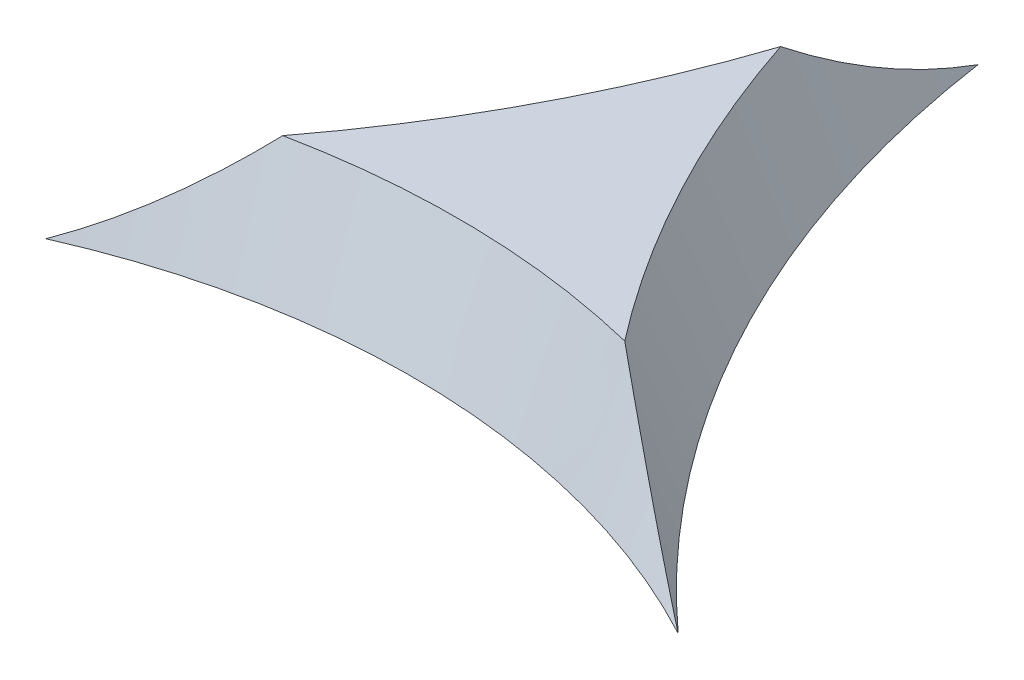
ISO-10303-21;
HEADER;
FILE_DESCRIPTION(('STEP AP214'),'2;1');
FILE_NAME('part.step','',(''),(''),'','','');
FILE_SCHEMA(('AUTOMOTIVE_DESIGN { 1 0 10303 214 1 1 1 1 }'));
ENDSEC;
DATA;
#1=APPLICATION_CONTEXT('core data for automotive mechanical design processes');
#2=APPLICATION_PROTOCOL_DEFINITION('international standard','automotive_design',2000,#1);
#3=PRODUCT_CONTEXT('',#1,'mechanical');
#4=PRODUCT('Part','Part','',(#3));
#5=PRODUCT_RELATED_PRODUCT_CATEGORY('part','',(#4));
#6=PRODUCT_DEFINITION_FORMATION('','',#4);
#7=PRODUCT_DEFINITION_CONTEXT('part definition',#1,'design');
#8=PRODUCT_DEFINITION('design','',#6,#7);
#9=PRODUCT_DEFINITION_SHAPE('','',#8);
#10=(LENGTH_UNIT() NAMED_UNIT(*) SI_UNIT(.MILLI.,.METRE.));
#11=(NAMED_UNIT(*) PLANE_ANGLE_UNIT() SI_UNIT($,.RADIAN.));
#12=(NAMED_UNIT(*) SI_UNIT($,.STERADIAN.) SOLID_ANGLE_UNIT());
#13=UNCERTAINTY_MEASURE_WITH_UNIT(LENGTH_MEASURE(1.E-05),#10,'distance_accuracy_value','');
#14=(GEOMETRIC_REPRESENTATION_CONTEXT(3) GLOBAL_UNCERTAINTY_ASSIGNED_CONTEXT((#13)) GLOBAL_UNIT_ASSIGNED_CONTEXT((#10,
#11,#12)) REPRESENTATION_CONTEXT('',''));
#15=CARTESIAN_POINT('',(0.,0.,0.));
#16=DIRECTION('',(0.,0.,1.));
#17=DIRECTION('',(1.,0.,0.));
#18=AXIS2_PLACEMENT_3D('',#15,#16,#17);
#19=CARTESIAN_POINT('',(-41.768203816,12.9,6.72190787));
#20=DIRECTION('',(0.,-1.,0.));
#21=DIRECTION('',(0.,0.,-1.));
#22=AXIS2_PLACEMENT_3D('',#19,#20,#21);
#23=PLANE('',#22);
#24=CARTESIAN_POINT('',(-40.5,12.9,12.8));
#25=DIRECTION('',(0.,1.,0.));
#26=DIRECTION('',(0.,0.,1.));
#27=AXIS2_PLACEMENT_3D('',#24,#25,#26);
#28=CIRCLE('',#27,6.27408270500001);
#29=CARTESIAN_POINT('',(-39.0068278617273,12.9000000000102,6.70618750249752));
#30=VERTEX_POINT('',#29);
#31=CARTESIAN_POINT('',(-41.7517343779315,12.9,6.65205116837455));
#32=VERTEX_POINT('',#31);
#33=EDGE_CURVE('E11',#30,#32,#28,.T.);
#34=ORIENTED_EDGE('',*,*,#33,.F.);
#35=CARTESIAN_POINT('',(-32.,12.9,1.3));
#36=DIRECTION('',(0.,1.,0.));
#37=DIRECTION('',(0.,0.,1.));
#38=AXIS2_PLACEMENT_3D('',#35,#36,#37);
#39=CIRCLE('',#38,8.85);
#40=CARTESIAN_POINT('',(-40.4000000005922,12.9,4.08612634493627));
#41=VERTEX_POINT('',#40);
#42=EDGE_CURVE('E71',#41,#30,#39,.T.);
#43=ORIENTED_EDGE('',*,*,#42,.F.);
#44=CARTESIAN_POINT('',(-48.8,12.9,1.3));
#45=DIRECTION('',(0.,1.,0.));
#46=DIRECTION('',(0.,0.,1.));
#47=AXIS2_PLACEMENT_3D('',#44,#45,#46);
#48=CIRCLE('',#47,8.85);
#49=EDGE_CURVE('E28',#32,#41,#48,.T.);
#50=ORIENTED_EDGE('',*,*,#49,.F.);
#51=EDGE_LOOP('',(#34,#43,#50));
#52=FACE_BOUND('',#51,.T.);
#53=ADVANCED_FACE('F16',(#52),#23,.F.);
#54=CARTESIAN_POINT('',(-40.5,12.,12.8));
#55=DIRECTION('',(0.,1.,0.));
#56=DIRECTION('',(0.,0.,1.));
#57=AXIS2_PLACEMENT_3D('',#54,#55,#56);
#58=CONICAL_SURFACE('',#57,5.914082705,0.380506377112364);
#59=CARTESIAN_POINT('',(-42.8807778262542,11.9999999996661,7.38628859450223));
#60=CARTESIAN_POINT('',(-42.8340665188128,12.0250127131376,7.35481564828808));
#61=CARTESIAN_POINT('',(-42.7878032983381,12.0513898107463,7.32378321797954));
#62=CARTESIAN_POINT('',(-42.6951118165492,12.1072774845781,7.26187571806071));
#63=CARTESIAN_POINT('',(-42.6487051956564,12.136847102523,7.23102145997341));
#64=CARTESIAN_POINT('',(-42.5556852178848,12.1991152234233,7.169446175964));
#65=CARTESIAN_POINT('',(-42.5090970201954,12.2318744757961,7.13874881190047));
#66=CARTESIAN_POINT('',(-42.4156686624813,12.3005212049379,7.07745759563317));
#67=CARTESIAN_POINT('',(-42.3688565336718,12.3364697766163,7.04688959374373));
#68=CARTESIAN_POINT('',(-42.274939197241,12.4114950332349,6.98582834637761));
#69=CARTESIAN_POINT('',(-42.2278643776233,12.450631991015,6.95536260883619));
#70=CARTESIAN_POINT('',(-42.1333825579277,12.5320357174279,6.89447648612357));
#71=CARTESIAN_POINT('',(-42.0860077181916,12.5743610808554,6.86408469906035));
#72=CARTESIAN_POINT('',(-41.9908894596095,12.6621417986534,6.80331690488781));
#73=CARTESIAN_POINT('',(-41.943179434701,12.7076533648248,6.77297006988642));
#74=CARTESIAN_POINT('',(-41.8473564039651,12.8018160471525,6.71226276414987));
#75=CARTESIAN_POINT('',(-41.7992775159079,12.8505208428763,6.68193158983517));
#76=CARTESIAN_POINT('',(-41.7517343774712,12.8999999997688,6.65205116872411));
#77=B_SPLINE_CURVE_WITH_KNOTS('',3,(#59,#60,#61,#62,#63,#64,#65,#66,#67,#68,#69,#70,#71,#72,#73,
#74,#75,#76),.UNSPECIFIED.,.F.,.F.,(4,2,2,2,2,2,2,2,4),(0.,0.184852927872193,0.37404714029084,
0.568088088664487,0.767442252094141,0.972537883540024,1.18376646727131,1.40148467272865,
1.62601661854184),.UNSPECIFIED.);
#78=CARTESIAN_POINT('',(-42.8807778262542,11.9999999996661,7.38628859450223));
#79=VERTEX_POINT('',#78);
#80=EDGE_CURVE('E78',#79,#32,#77,.T.);
#81=ORIENTED_EDGE('',*,*,#80,.F.);
#82=CARTESIAN_POINT('',(-40.5,12.,12.8));
#83=DIRECTION('',(0.,1.,0.));
#84=DIRECTION('',(0.,0.,1.));
#85=AXIS2_PLACEMENT_3D('',#82,#83,#84);
#86=CIRCLE('',#85,5.914082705);
#87=CARTESIAN_POINT('',(-37.7035871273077,12.0000000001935,7.58881498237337));
#88=VERTEX_POINT('',#87);
#89=EDGE_CURVE('E74',#88,#79,#86,.T.);
#90=ORIENTED_EDGE('',*,*,#89,.F.);
#91=CARTESIAN_POINT('',(-39.0068278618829,12.8999999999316,6.70618750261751));
#92=CARTESIAN_POINT('',(-38.9518914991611,12.8458770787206,6.74194317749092));
#93=CARTESIAN_POINT('',(-38.8962290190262,12.7928768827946,6.77832498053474));
#94=CARTESIAN_POINT('',(-38.7853588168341,12.6913851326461,6.85114730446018));
#95=CARTESIAN_POINT('',(-38.7302048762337,12.6428003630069,6.88754005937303));
#96=CARTESIAN_POINT('',(-38.6202973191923,12.5501303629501,6.96043579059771));
#97=CARTESIAN_POINT('',(-38.5655950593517,12.5059478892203,6.99689201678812));
#98=CARTESIAN_POINT('',(-38.4565367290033,12.422090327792,7.0699628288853));
#99=CARTESIAN_POINT('',(-38.4022282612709,12.3823148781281,7.10653291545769));
#100=CARTESIAN_POINT('',(-38.2939000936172,12.3072730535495,7.17987698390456));
#101=CARTESIAN_POINT('',(-38.2399229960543,12.271905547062,7.21661001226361));
#102=CARTESIAN_POINT('',(-38.1321990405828,12.2056795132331,7.29032112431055));
#103=CARTESIAN_POINT('',(-38.0784885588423,12.1747220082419,7.32726313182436));
#104=CARTESIAN_POINT('',(-37.9712331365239,12.1173142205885,7.40143323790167));
#105=CARTESIAN_POINT('',(-37.9177175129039,12.0907707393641,7.43863119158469));
#106=CARTESIAN_POINT('',(-37.8107976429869,12.0421787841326,7.51333821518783));
#107=CARTESIAN_POINT('',(-37.7574148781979,12.0200472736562,7.55082415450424));
#108=CARTESIAN_POINT('',(-37.7035871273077,12.0000000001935,7.58881498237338));
#109=B_SPLINE_CURVE_WITH_KNOTS('',3,(#91,#92,#93,#94,#95,#96,#97,#98,#99,#100,#101,#102,#103,
#104,#105,#106,#107,#108),.UNSPECIFIED.,.F.,.F.,(4,2,2,2,2,2,2,2,4),(0.,0.255026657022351,
0.501016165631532,0.738553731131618,0.968292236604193,1.19095650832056,1.40734606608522,
1.61833564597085,1.82487276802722),.UNSPECIFIED.);
#110=EDGE_CURVE('E63',#30,#88,#109,.T.);
#111=ORIENTED_EDGE('',*,*,#110,.F.);
#112=ORIENTED_EDGE('',*,*,#33,.T.);
#113=EDGE_LOOP('',(#81,#90,#111,#112));
#114=FACE_BOUND('',#113,.T.);
#115=ADVANCED_FACE('F18',(#114),#58,.F.);
#116=CARTESIAN_POINT('',(-48.8,12.,1.3));
#117=DIRECTION('',(0.,1.,0.));
#118=DIRECTION('',(0.,0.,1.));
#119=AXIS2_PLACEMENT_3D('',#116,#117,#118);
#120=CONICAL_SURFACE('',#119,8.49,0.380506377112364);
#121=CARTESIAN_POINT('',(-40.4,12.0000000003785,2.53292335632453));
#122=CARTESIAN_POINT('',(-40.3999992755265,12.0236083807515,2.59795974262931));
#123=CARTESIAN_POINT('',(-40.3999923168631,12.048817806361,2.6624035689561));
#124=CARTESIAN_POINT('',(-40.399973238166,12.1027050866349,2.79128161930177));
#125=CARTESIAN_POINT('',(-40.399961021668,12.1314402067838,2.85569193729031));
#126=CARTESIAN_POINT('',(-40.3999391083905,12.1923744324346,2.98455998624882));
#127=CARTESIAN_POINT('',(-40.3999294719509,12.2246351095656,3.04898849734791));
#128=CARTESIAN_POINT('',(-40.3999163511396,12.2926165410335,3.17795743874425));
#129=CARTESIAN_POINT('',(-40.3999130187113,12.3284013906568,3.24246400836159));
#130=CARTESIAN_POINT('',(-40.3999136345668,12.4034291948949,3.37164931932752));
#131=CARTESIAN_POINT('',(-40.3999177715,12.4427372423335,3.43629015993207));
#132=CARTESIAN_POINT('',(-40.3999317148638,12.524811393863,3.56580306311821));
#133=CARTESIAN_POINT('',(-40.3999416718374,12.567642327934,3.63063395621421));
#134=CARTESIAN_POINT('',(-40.399963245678,12.6567611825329,3.76058316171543));
#135=CARTESIAN_POINT('',(-40.3999749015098,12.7031125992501,3.82565779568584));
#136=CARTESIAN_POINT('',(-40.3999932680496,12.7992809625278,3.95615039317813));
#137=CARTESIAN_POINT('',(-40.3999998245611,12.8491595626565,4.02152298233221));
#138=CARTESIAN_POINT('',(-40.3999999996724,12.9000000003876,4.08612634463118));
#139=B_SPLINE_CURVE_WITH_KNOTS('',3,(#121,#122,#123,#124,#125,#126,#127,#128,#129,#130,#131,
#132,#133,#134,#135,#136,#137,#138),.UNSPECIFIED.,.F.,.F.,(4,2,2,2,2,2,2,2,4),(0.,
0.207529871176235,0.419041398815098,0.635136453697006,0.856376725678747,1.08328310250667,
1.31633605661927,1.55597682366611,1.80260916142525),.UNSPECIFIED.);
#140=CARTESIAN_POINT('',(-40.4,12.0000000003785,2.53292335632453));
#141=VERTEX_POINT('',#140);
#142=EDGE_CURVE('E73',#141,#41,#139,.T.);
#143=ORIENTED_EDGE('',*,*,#142,.F.);
#144=CARTESIAN_POINT('',(-48.8,12.,1.3));
#145=DIRECTION('',(0.,1.,0.));
#146=DIRECTION('',(0.,0.,1.));
#147=AXIS2_PLACEMENT_3D('',#144,#145,#146);
#148=CIRCLE('',#147,8.49);
#149=EDGE_CURVE('E85',#79,#141,#148,.T.);
#150=ORIENTED_EDGE('',*,*,#149,.F.);
#151=ORIENTED_EDGE('',*,*,#80,.T.);
#152=ORIENTED_EDGE('',*,*,#49,.T.);
#153=EDGE_LOOP('',(#143,#150,#151,#152));
#154=FACE_BOUND('',#153,.T.);
#155=ADVANCED_FACE('F120',(#154),#120,.F.);
#156=CARTESIAN_POINT('',(-32.,12.,1.3));
#157=DIRECTION('',(0.,1.,0.));
#158=DIRECTION('',(0.,0.,1.));
#159=AXIS2_PLACEMENT_3D('',#156,#157,#158);
#160=CONICAL_SURFACE('',#159,8.49,0.380506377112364);
#161=ORIENTED_EDGE('',*,*,#110,.T.);
#162=CARTESIAN_POINT('',(-32.,12.,1.3));
#163=DIRECTION('',(0.,1.,0.));
#164=DIRECTION('',(0.,0.,1.));
#165=AXIS2_PLACEMENT_3D('',#162,#163,#164);
#166=CIRCLE('',#165,8.49);
#167=EDGE_CURVE('E69',#141,#88,#166,.T.);
#168=ORIENTED_EDGE('',*,*,#167,.F.);
#169=ORIENTED_EDGE('',*,*,#142,.T.);
#170=ORIENTED_EDGE('',*,*,#42,.T.);
#171=EDGE_LOOP('',(#161,#168,#169,#170));
#172=FACE_BOUND('',#171,.T.);
#173=ADVANCED_FACE('F66',(#172),#160,.F.);
#174=CARTESIAN_POINT('',(-42.91184097,12.,7.619150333));
#175=DIRECTION('',(0.,-1.,0.));
#176=DIRECTION('',(0.,0.,-1.));
#177=AXIS2_PLACEMENT_3D('',#174,#175,#176);
#178=PLANE('',#177);
#179=ORIENTED_EDGE('',*,*,#149,.T.);
#180=ORIENTED_EDGE('',*,*,#167,.T.);
#181=ORIENTED_EDGE('',*,*,#89,.T.);
#182=EDGE_LOOP('',(#179,#180,#181));
#183=FACE_BOUND('',#182,.T.);
#184=ADVANCED_FACE('F84',(#183),#178,.T.);
#185=CLOSED_SHELL('',(#53,#115,#155,#173,#184));
#186=MANIFOLD_SOLID_BREP('B1',#185);
#187=ADVANCED_BREP_SHAPE_REPRESENTATION('',(#18,#186),#14);
#188=SHAPE_DEFINITION_REPRESENTATION(#9,#187);
ENDSEC;
END-ISO-10303-21;
